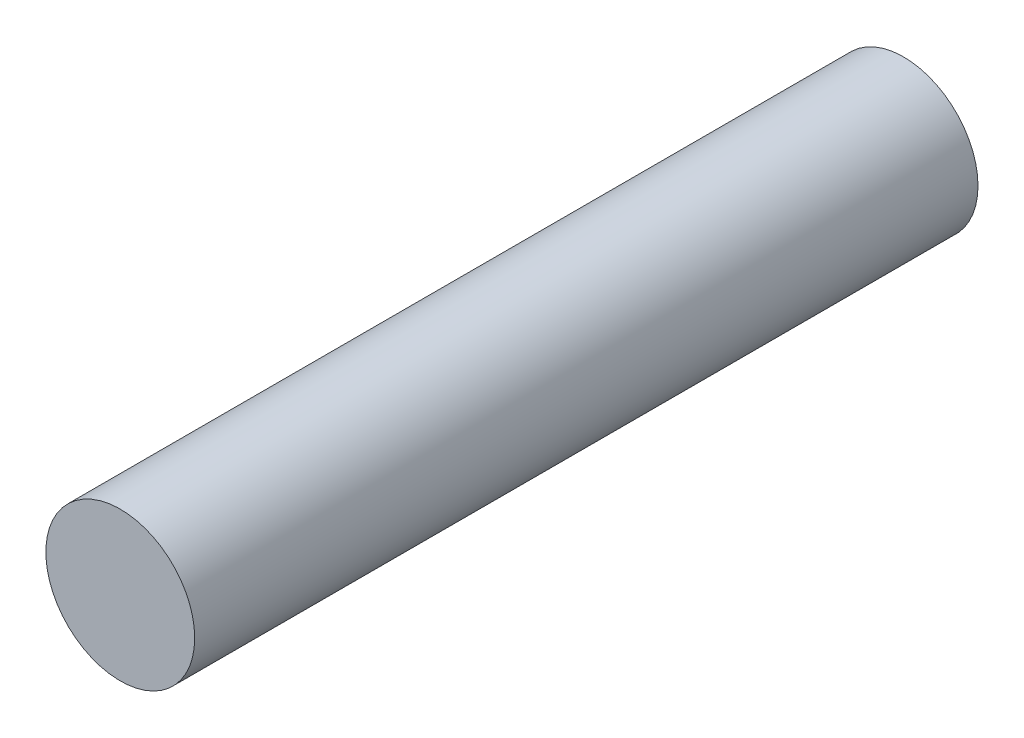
ISO-10303-21;
HEADER;
FILE_DESCRIPTION(('STEP AP214'),'2;1');
FILE_NAME('part.step','',(''),(''),'','','');
FILE_SCHEMA(('AUTOMOTIVE_DESIGN { 1 0 10303 214 1 1 1 1 }'));
ENDSEC;
DATA;
#1=APPLICATION_CONTEXT('core data for automotive mechanical design processes');
#2=APPLICATION_PROTOCOL_DEFINITION('international standard','automotive_design',2000,#1);
#3=PRODUCT_CONTEXT('',#1,'mechanical');
#4=PRODUCT('Part','Part','',(#3));
#5=PRODUCT_RELATED_PRODUCT_CATEGORY('part','',(#4));
#6=PRODUCT_DEFINITION_FORMATION('','',#4);
#7=PRODUCT_DEFINITION_CONTEXT('part definition',#1,'design');
#8=PRODUCT_DEFINITION('design','',#6,#7);
#9=PRODUCT_DEFINITION_SHAPE('','',#8);
#10=(LENGTH_UNIT() NAMED_UNIT(*) SI_UNIT(.MILLI.,.METRE.));
#11=(NAMED_UNIT(*) PLANE_ANGLE_UNIT() SI_UNIT($,.RADIAN.));
#12=(NAMED_UNIT(*) SI_UNIT($,.STERADIAN.) SOLID_ANGLE_UNIT());
#13=UNCERTAINTY_MEASURE_WITH_UNIT(LENGTH_MEASURE(1.E-05),#10,'distance_accuracy_value','');
#14=(GEOMETRIC_REPRESENTATION_CONTEXT(3) GLOBAL_UNCERTAINTY_ASSIGNED_CONTEXT((#13)) GLOBAL_UNIT_ASSIGNED_CONTEXT((#10,
#11,#12)) REPRESENTATION_CONTEXT('',''));
#15=CARTESIAN_POINT('',(0.,0.,0.));
#16=DIRECTION('',(0.,0.,1.));
#17=DIRECTION('',(1.,0.,0.));
#18=AXIS2_PLACEMENT_3D('',#15,#16,#17);
#19=CARTESIAN_POINT('',(0.,0.,10.));
#20=DIRECTION('',(0.,0.,-1.));
#21=DIRECTION('',(-1.,0.,0.));
#22=AXIS2_PLACEMENT_3D('',#19,#20,#21);
#23=CYLINDRICAL_SURFACE('',#22,0.95);
#24=CARTESIAN_POINT('',(0.,0.,10.));
#25=DIRECTION('',(0.,0.,1.));
#26=DIRECTION('',(1.,0.,0.));
#27=AXIS2_PLACEMENT_3D('',#24,#25,#26);
#28=CIRCLE('',#27,0.95);
#29=CARTESIAN_POINT('',(0.95,0.,10.));
#30=VERTEX_POINT('',#29);
#31=EDGE_CURVE('E10',#30,#30,#28,.T.);
#32=ORIENTED_EDGE('',*,*,#31,.F.);
#33=EDGE_LOOP('',(#32));
#34=FACE_BOUND('',#33,.T.);
#35=CARTESIAN_POINT('',(0.,0.,0.));
#36=DIRECTION('',(0.,0.,1.));
#37=DIRECTION('',(1.,0.,0.));
#38=AXIS2_PLACEMENT_3D('',#35,#36,#37);
#39=CIRCLE('',#38,0.95);
#40=CARTESIAN_POINT('',(0.95,0.,0.));
#41=VERTEX_POINT('',#40);
#42=EDGE_CURVE('E31',#41,#41,#39,.T.);
#43=ORIENTED_EDGE('',*,*,#42,.T.);
#44=EDGE_LOOP('',(#43));
#45=FACE_BOUND('',#44,.T.);
#46=ADVANCED_FACE('F28',(#34,#45),#23,.T.);
#47=CARTESIAN_POINT('',(0.,0.,10.));
#48=DIRECTION('',(0.,0.,1.));
#49=DIRECTION('',(1.,0.,0.));
#50=AXIS2_PLACEMENT_3D('',#47,#48,#49);
#51=PLANE('',#50);
#52=ORIENTED_EDGE('',*,*,#31,.T.);
#53=EDGE_LOOP('',(#52));
#54=FACE_BOUND('',#53,.T.);
#55=ADVANCED_FACE('F43',(#54),#51,.T.);
#56=CARTESIAN_POINT('',(0.,0.,0.));
#57=DIRECTION('',(0.,0.,1.));
#58=DIRECTION('',(1.,0.,0.));
#59=AXIS2_PLACEMENT_3D('',#56,#57,#58);
#60=PLANE('',#59);
#61=ORIENTED_EDGE('',*,*,#42,.F.);
#62=EDGE_LOOP('',(#61));
#63=FACE_BOUND('',#62,.T.);
#64=ADVANCED_FACE('F41',(#63),#60,.F.);
#65=CLOSED_SHELL('',(#46,#55,#64));
#66=MANIFOLD_SOLID_BREP('B2',#65);
#67=ADVANCED_BREP_SHAPE_REPRESENTATION('',(#18,#66),#14);
#68=SHAPE_DEFINITION_REPRESENTATION(#9,#67);
ENDSEC;
END-ISO-10303-21;
